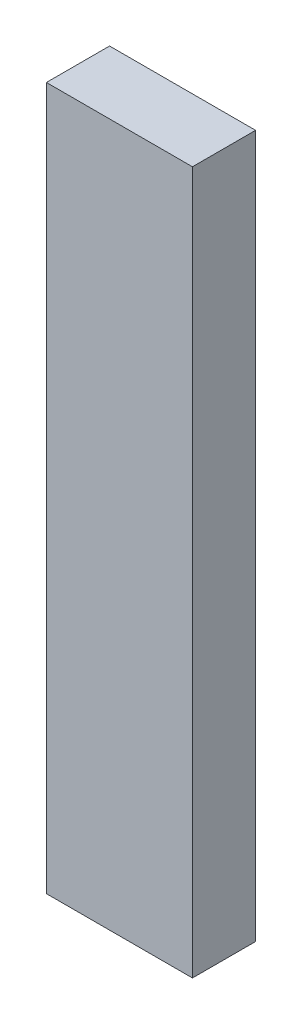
from build123d import *

# Parameters (mm, degrees)
ESQUISSE1_W      = 18.5
ESQUISSE1_H      = 89
EXTRUSION1_DEPTH = 8


with BuildPart() as part:
    # Esquisse1 → Extrusion1 (new body)
    with BuildSketch(Plane.XY):
        with Locations((9.25, 44.5)):
            Rectangle(ESQUISSE1_W, ESQUISSE1_H)
    extrude(amount=EXTRUSION1_DEPTH)


solid = part.part
